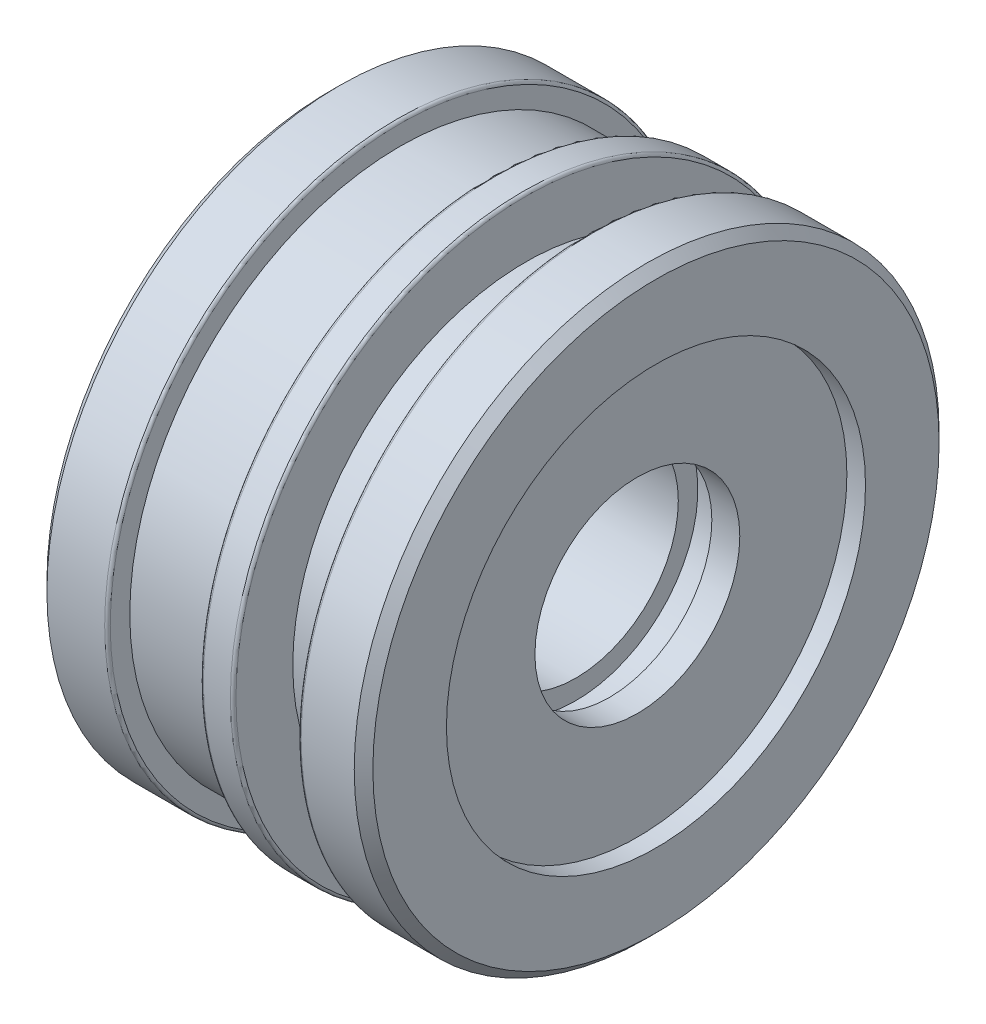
from build123d import *

# Parameters (mm, degrees)
CHANFREIN1_SIZE = 1
CONG_1_R        = 0.3


with BuildPart() as part:
    # Esquisse1 → R_volution1 (revolve)
    with BuildSketch(Plane.XY, mode=Mode.PRIVATE) as r_volution1_sk:
        Polygon((0, 15), (0, 31.4), (7.5, 31.4), (7.5, 29), (17.5, 29), (17.5, 31.4), (21, 31.4), (21, 25), (28, 25), (28, 31.4), (35, 31.4), (35, 22.5), (33, 22.5), (33, 11), (30, 11), (30, 13.1), (26.4, 13.1), (26.4, 11), (6.5, 11), (6.5, 15), align=None)
    revolve(r_volution1_sk.sketch.rotate(Axis((0, 0, 0), (1, 0, 0)), 90), axis=Axis((0, 0, 0), (1, 0, 0)))

    # Chanfrein1
    chanfrein1_edges = [part.edges().sort_by_distance(p)[0] for p in [
        (0, 0, -31.4),
        (35, 0, -31.4),
    ]]
    chamfer(chanfrein1_edges, length=CHANFREIN1_SIZE)

    # Cong_1
    cong_1_edges = [part.edges().sort_by_distance(p)[0] for p in [
        (28, 0, -31.4),
        (21, 0, -31.4),
        (17.5, 0, -31.4),
        (7.5, 0, -31.4),
    ]]
    fillet(cong_1_edges, radius=CONG_1_R)


solid = part.part
